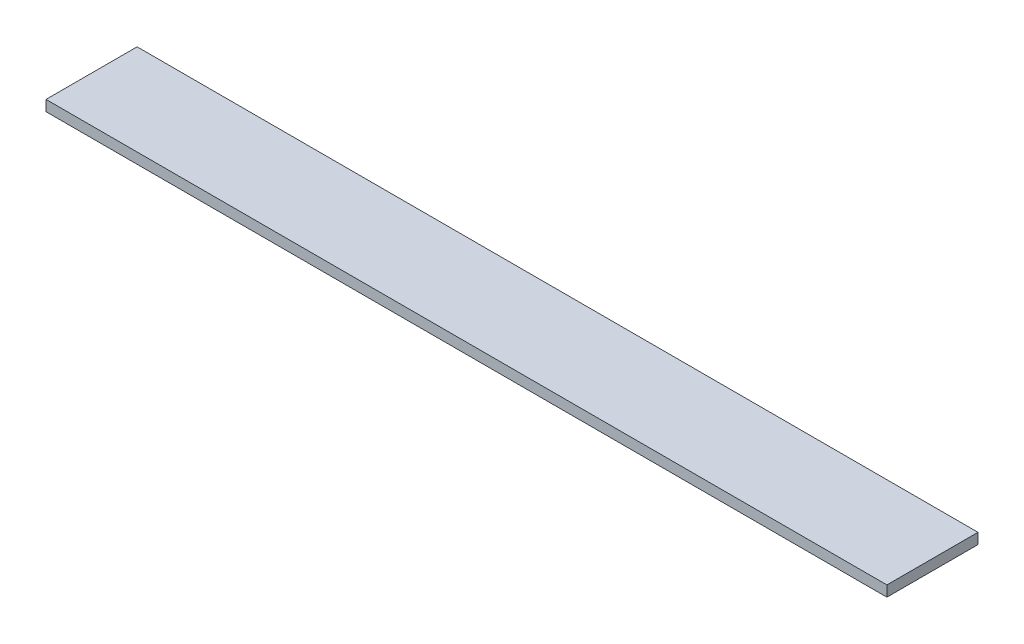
ISO-10303-21;
HEADER;
FILE_DESCRIPTION(('STEP AP214'),'2;1');
FILE_NAME('part.step','',(''),(''),'','','');
FILE_SCHEMA(('AUTOMOTIVE_DESIGN { 1 0 10303 214 1 1 1 1 }'));
ENDSEC;
DATA;
#1=APPLICATION_CONTEXT('core data for automotive mechanical design processes');
#2=APPLICATION_PROTOCOL_DEFINITION('international standard','automotive_design',2000,#1);
#3=PRODUCT_CONTEXT('',#1,'mechanical');
#4=PRODUCT('Part','Part','',(#3));
#5=PRODUCT_RELATED_PRODUCT_CATEGORY('part','',(#4));
#6=PRODUCT_DEFINITION_FORMATION('','',#4);
#7=PRODUCT_DEFINITION_CONTEXT('part definition',#1,'design');
#8=PRODUCT_DEFINITION('design','',#6,#7);
#9=PRODUCT_DEFINITION_SHAPE('','',#8);
#10=(LENGTH_UNIT() NAMED_UNIT(*) SI_UNIT(.MILLI.,.METRE.));
#11=(NAMED_UNIT(*) PLANE_ANGLE_UNIT() SI_UNIT($,.RADIAN.));
#12=(NAMED_UNIT(*) SI_UNIT($,.STERADIAN.) SOLID_ANGLE_UNIT());
#13=UNCERTAINTY_MEASURE_WITH_UNIT(LENGTH_MEASURE(1.E-05),#10,'distance_accuracy_value','');
#14=(GEOMETRIC_REPRESENTATION_CONTEXT(3) GLOBAL_UNCERTAINTY_ASSIGNED_CONTEXT((#13)) GLOBAL_UNIT_ASSIGNED_CONTEXT((#10,
#11,#12)) REPRESENTATION_CONTEXT('',''));
#15=CARTESIAN_POINT('',(0.,0.,0.));
#16=DIRECTION('',(0.,0.,1.));
#17=DIRECTION('',(1.,0.,0.));
#18=AXIS2_PLACEMENT_3D('',#15,#16,#17);
#19=CARTESIAN_POINT('',(0.,9.652,0.));
#20=DIRECTION('',(1.,0.,0.));
#21=DIRECTION('',(0.,0.,-1.));
#22=AXIS2_PLACEMENT_3D('',#19,#20,#21);
#23=PLANE('',#22);
#24=DIRECTION('',(0.,0.,1.));
#25=VECTOR('',#24,1.);
#26=CARTESIAN_POINT('',(0.,0.,0.));
#27=LINE('',#26,#25);
#28=CARTESIAN_POINT('',(0.,0.,-82.55));
#29=VERTEX_POINT('',#28);
#30=CARTESIAN_POINT('',(0.,0.,0.));
#31=VERTEX_POINT('',#30);
#32=EDGE_CURVE('E72',#29,#31,#27,.T.);
#33=ORIENTED_EDGE('',*,*,#32,.T.);
#34=DIRECTION('',(0.,-1.,0.));
#35=VECTOR('',#34,1.);
#36=CARTESIAN_POINT('',(0.,9.652,0.));
#37=LINE('',#36,#35);
#38=CARTESIAN_POINT('',(0.,9.652,0.));
#39=VERTEX_POINT('',#38);
#40=EDGE_CURVE('E11',#39,#31,#37,.T.);
#41=ORIENTED_EDGE('',*,*,#40,.F.);
#42=DIRECTION('',(0.,0.,1.));
#43=VECTOR('',#42,1.);
#44=CARTESIAN_POINT('',(0.,9.652,0.));
#45=LINE('',#44,#43);
#46=CARTESIAN_POINT('',(0.,9.652,-82.55));
#47=VERTEX_POINT('',#46);
#48=EDGE_CURVE('E90',#47,#39,#45,.T.);
#49=ORIENTED_EDGE('',*,*,#48,.F.);
#50=DIRECTION('',(0.,-1.,0.));
#51=VECTOR('',#50,1.);
#52=CARTESIAN_POINT('',(0.,9.652,-82.55));
#53=LINE('',#52,#51);
#54=EDGE_CURVE('E84',#47,#29,#53,.T.);
#55=ORIENTED_EDGE('',*,*,#54,.T.);
#56=EDGE_LOOP('',(#33,#41,#49,#55));
#57=FACE_BOUND('',#56,.T.);
#58=ADVANCED_FACE('F28',(#57),#23,.F.);
#59=CARTESIAN_POINT('',(0.,9.652,0.));
#60=DIRECTION('',(0.,0.,-1.));
#61=DIRECTION('',(-1.,0.,0.));
#62=AXIS2_PLACEMENT_3D('',#59,#60,#61);
#63=PLANE('',#62);
#64=DIRECTION('',(1.,0.,0.));
#65=VECTOR('',#64,1.);
#66=CARTESIAN_POINT('',(0.,0.,0.));
#67=LINE('',#66,#65);
#68=CARTESIAN_POINT('',(762.,0.,0.));
#69=VERTEX_POINT('',#68);
#70=EDGE_CURVE('E68',#31,#69,#67,.T.);
#71=ORIENTED_EDGE('',*,*,#70,.T.);
#72=DIRECTION('',(0.,-1.,0.));
#73=VECTOR('',#72,1.);
#74=CARTESIAN_POINT('',(762.,9.652,0.));
#75=LINE('',#74,#73);
#76=CARTESIAN_POINT('',(762.,9.652,0.));
#77=VERTEX_POINT('',#76);
#78=EDGE_CURVE('E35',#77,#69,#75,.T.);
#79=ORIENTED_EDGE('',*,*,#78,.F.);
#80=DIRECTION('',(1.,0.,0.));
#81=VECTOR('',#80,1.);
#82=CARTESIAN_POINT('',(0.,9.652,0.));
#83=LINE('',#82,#81);
#84=EDGE_CURVE('E80',#39,#77,#83,.T.);
#85=ORIENTED_EDGE('',*,*,#84,.F.);
#86=ORIENTED_EDGE('',*,*,#40,.T.);
#87=EDGE_LOOP('',(#71,#79,#85,#86));
#88=FACE_BOUND('',#87,.T.);
#89=ADVANCED_FACE('F79',(#88),#63,.F.);
#90=CARTESIAN_POINT('',(762.,9.652,0.));
#91=DIRECTION('',(-1.,0.,0.));
#92=DIRECTION('',(0.,0.,1.));
#93=AXIS2_PLACEMENT_3D('',#90,#91,#92);
#94=PLANE('',#93);
#95=DIRECTION('',(0.,0.,-1.));
#96=VECTOR('',#95,1.);
#97=CARTESIAN_POINT('',(762.,0.,0.));
#98=LINE('',#97,#96);
#99=CARTESIAN_POINT('',(762.,0.,-82.55));
#100=VERTEX_POINT('',#99);
#101=EDGE_CURVE('E73',#69,#100,#98,.T.);
#102=ORIENTED_EDGE('',*,*,#101,.T.);
#103=DIRECTION('',(0.,-1.,0.));
#104=VECTOR('',#103,1.);
#105=CARTESIAN_POINT('',(762.,9.652,-82.55));
#106=LINE('',#105,#104);
#107=CARTESIAN_POINT('',(762.,9.652,-82.55));
#108=VERTEX_POINT('',#107);
#109=EDGE_CURVE('E96',#108,#100,#106,.T.);
#110=ORIENTED_EDGE('',*,*,#109,.F.);
#111=DIRECTION('',(0.,0.,-1.));
#112=VECTOR('',#111,1.);
#113=CARTESIAN_POINT('',(762.,9.652,0.));
#114=LINE('',#113,#112);
#115=EDGE_CURVE('E47',#77,#108,#114,.T.);
#116=ORIENTED_EDGE('',*,*,#115,.F.);
#117=ORIENTED_EDGE('',*,*,#78,.T.);
#118=EDGE_LOOP('',(#102,#110,#116,#117));
#119=FACE_BOUND('',#118,.T.);
#120=ADVANCED_FACE('F99',(#119),#94,.F.);
#121=CARTESIAN_POINT('',(0.,9.652,-82.55));
#122=DIRECTION('',(0.,0.,1.));
#123=DIRECTION('',(1.,0.,0.));
#124=AXIS2_PLACEMENT_3D('',#121,#122,#123);
#125=PLANE('',#124);
#126=DIRECTION('',(-1.,0.,0.));
#127=VECTOR('',#126,1.);
#128=CARTESIAN_POINT('',(0.,0.,-82.55));
#129=LINE('',#128,#127);
#130=EDGE_CURVE('E88',#100,#29,#129,.T.);
#131=ORIENTED_EDGE('',*,*,#130,.T.);
#132=ORIENTED_EDGE('',*,*,#54,.F.);
#133=DIRECTION('',(-1.,0.,0.));
#134=VECTOR('',#133,1.);
#135=CARTESIAN_POINT('',(0.,9.652,-82.55));
#136=LINE('',#135,#134);
#137=EDGE_CURVE('E42',#108,#47,#136,.T.);
#138=ORIENTED_EDGE('',*,*,#137,.F.);
#139=ORIENTED_EDGE('',*,*,#109,.T.);
#140=EDGE_LOOP('',(#131,#132,#138,#139));
#141=FACE_BOUND('',#140,.T.);
#142=ADVANCED_FACE('F101',(#141),#125,.F.);
#143=CARTESIAN_POINT('',(0.,9.652,-82.55));
#144=DIRECTION('',(0.,-1.,0.));
#145=DIRECTION('',(0.,0.,-1.));
#146=AXIS2_PLACEMENT_3D('',#143,#144,#145);
#147=PLANE('',#146);
#148=ORIENTED_EDGE('',*,*,#48,.T.);
#149=ORIENTED_EDGE('',*,*,#84,.T.);
#150=ORIENTED_EDGE('',*,*,#115,.T.);
#151=ORIENTED_EDGE('',*,*,#137,.T.);
#152=EDGE_LOOP('',(#148,#149,#150,#151));
#153=FACE_BOUND('',#152,.T.);
#154=ADVANCED_FACE('F102',(#153),#147,.F.);
#155=CARTESIAN_POINT('',(0.,0.,-82.55));
#156=DIRECTION('',(0.,-1.,0.));
#157=DIRECTION('',(0.,0.,-1.));
#158=AXIS2_PLACEMENT_3D('',#155,#156,#157);
#159=PLANE('',#158);
#160=ORIENTED_EDGE('',*,*,#32,.F.);
#161=ORIENTED_EDGE('',*,*,#130,.F.);
#162=ORIENTED_EDGE('',*,*,#101,.F.);
#163=ORIENTED_EDGE('',*,*,#70,.F.);
#164=EDGE_LOOP('',(#160,#161,#162,#163));
#165=FACE_BOUND('',#164,.T.);
#166=ADVANCED_FACE('F69',(#165),#159,.T.);
#167=CLOSED_SHELL('',(#58,#89,#120,#142,#154,#166));
#168=MANIFOLD_SOLID_BREP('B2',#167);
#169=ADVANCED_BREP_SHAPE_REPRESENTATION('',(#18,#168),#14);
#170=SHAPE_DEFINITION_REPRESENTATION(#9,#169);
ENDSEC;
END-ISO-10303-21;
